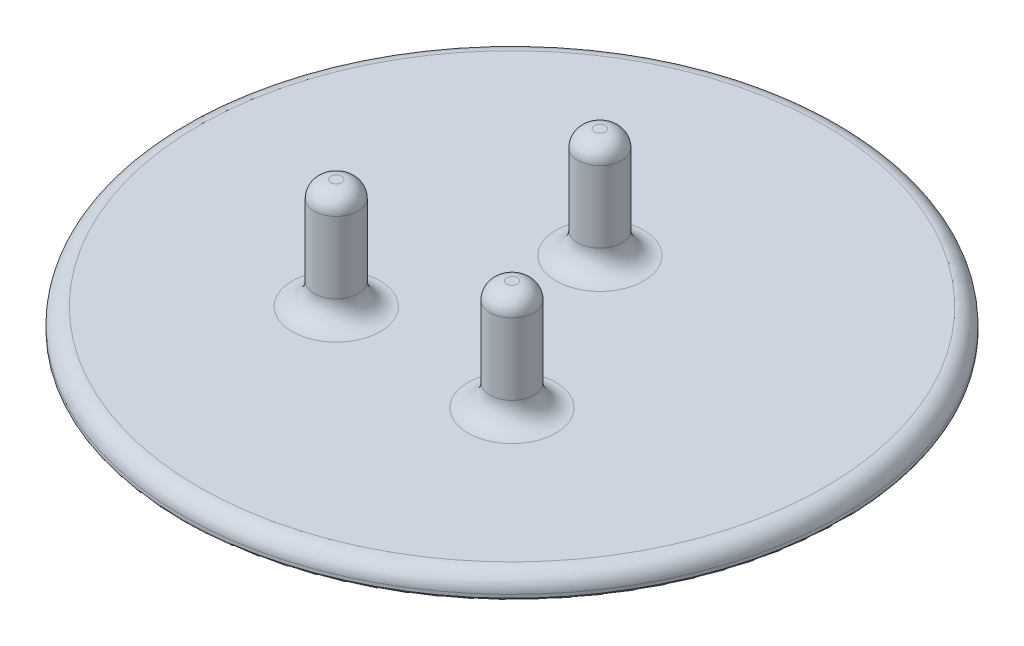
from build123d import *

# Parameters (mm, degrees)
SKETCH1_R           = 30
BOSS_EXTRUDE1_DEPTH = 2
SKETCH2_R           = 2
BOSS_EXTRUDE2_DEPTH = 10
FILLET1_R           = 2
FILLET3_R           = 1.5
SKETCH3_W           = 4.55
SKETCH3_H           = 4.55
BOSS_EXTRUDE3_DEPTH = 2.3
FILLET4_R           = 0.2


with BuildPart() as part:
    # Sketch1 → Boss-Extrude1 (new body)
    with BuildSketch(Plane(origin=(0, 0, 0), x_dir=(1, 0, 0), z_dir=(0, 1, 0))):
        with Locations(Location((0, 0, 0), (0, 0, 270))):
            Circle(SKETCH1_R)
    extrude(amount=BOSS_EXTRUDE1_DEPTH)

    # Sketch2 → Boss-Extrude2 (add)
    with BuildSketch(Plane(origin=(0, 2, 0), x_dir=(1, 0, 0), z_dir=(0, 1, 0))):
        with Locations(Location((0, 8, 0), (0, 0, 270))):
            Circle(SKETCH2_R)
        with Locations(Location((-8, -8, 0), (0, 0, 270))):
            Circle(SKETCH2_R)
        with Locations(Location((8, -8, 0), (0, 0, 270))):
            Circle(SKETCH2_R)
    extrude(amount=BOSS_EXTRUDE2_DEPTH)

    # Fillet1
    fillet1_edges = [part.edges().sort_by_distance(p)[0] for p in [
        (8, 2, 6),
        (0, 2, -10),
        (-8, 2, 6),
    ]]
    fillet(fillet1_edges, radius=FILLET1_R)

    # Fillet3
    fillet3_edges = [part.edges().sort_by_distance(p)[0] for p in [
        (8, 12, 6),
        (0, 2, -30),
        (0, 12, -10),
        (-8, 12, 6),
    ]]
    fillet(fillet3_edges, radius=FILLET3_R)

    # Sketch3 → Boss-Extrude3 (add)
    with BuildSketch(Plane.XZ):
        Rectangle(SKETCH3_W, SKETCH3_H)
        with Locations((0, 10)):
            Rectangle(SKETCH3_W, SKETCH3_H)
        with Locations((10, 0)):
            Rectangle(SKETCH3_W, SKETCH3_H)
        with Locations((0, -10)):
            Rectangle(SKETCH3_W, SKETCH3_H)
        with Locations((-10, 0)):
            Rectangle(SKETCH3_W, SKETCH3_H)
    extrude(amount=BOSS_EXTRUDE3_DEPTH)

    # Fillet4
    fillet4_edges = [part.edges().sort_by_distance(p)[0] for p in [
        (0, 0, -30),
        (-2.275, 0, 0),
        (0, 0, -2.275),
        (2.275, 0, 0),
        (0, 0, 2.275),
        (-2.275, -2.3, 0),
        (0, -2.3, -2.275),
        (2.275, -2.3, 0),
        (0, -2.3, 2.275),
        (2.275, 0, 10),
        (0, 0, 12.275),
        (-2.275, 0, 10),
        (0, 0, 7.725),
        (2.275, -2.3, 10),
        (0, -2.3, 12.275),
        (-2.275, -2.3, 10),
        (0, -2.3, 7.725),
        (7.725, 0, 0),
        (10, 0, -2.275),
        (12.275, 0, 0),
        (10, 0, 2.275),
        (7.725, -2.3, 0),
        (10, -2.3, -2.275),
        (12.275, -2.3, 0),
        (10, -2.3, 2.275),
        (-2.275, 0, -10),
        (0, 0, -12.275),
        (2.275, 0, -10),
        (0, 0, -7.725),
        (-2.275, -2.3, -10),
        (0, -2.3, -12.275),
        (2.275, -2.3, -10),
        (0, -2.3, -7.725),
        (-12.275, 0, 0),
        (-10, 0, -2.275),
        (-7.725, 0, 0),
        (-10, 0, 2.275),
        (-12.275, -2.3, 0),
        (-10, -2.3, -2.275),
        (-7.725, -2.3, 0),
        (-10, -2.3, 2.275),
    ]]
    fillet(fillet4_edges, radius=FILLET4_R)


solid = part.part
